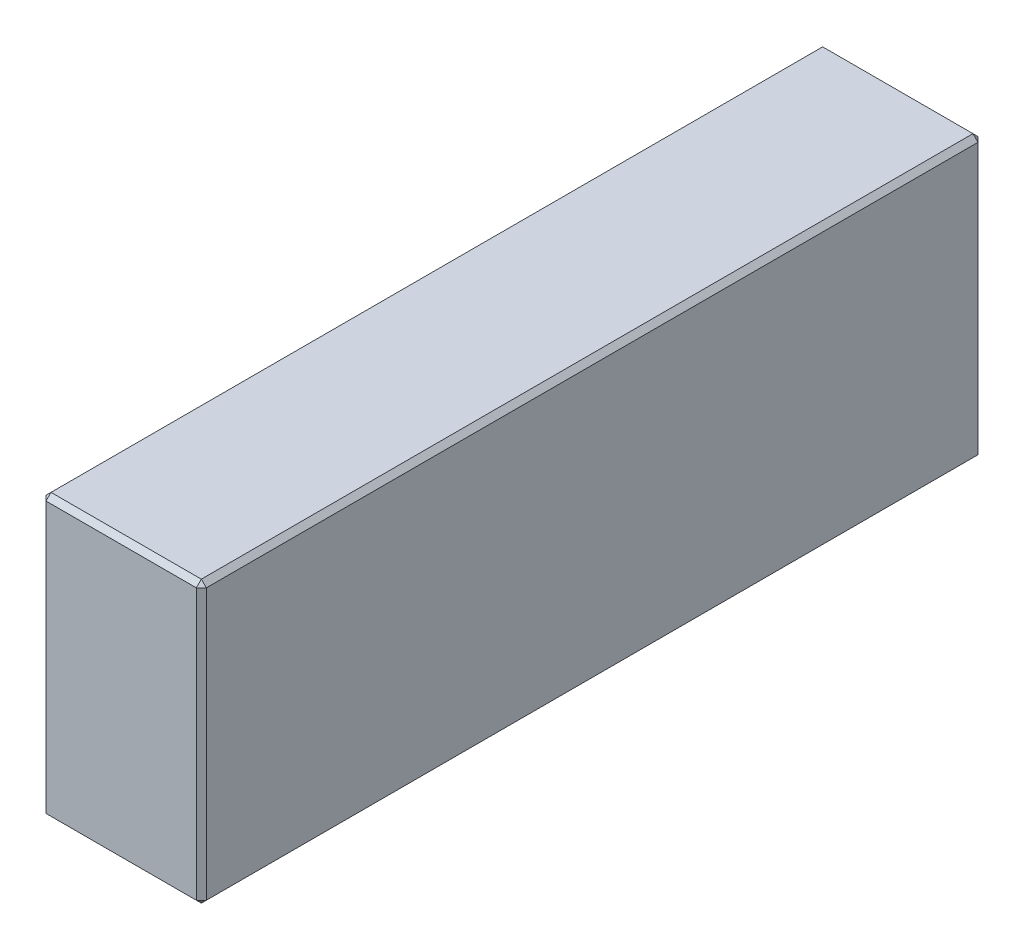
ISO-10303-21;
HEADER;
FILE_DESCRIPTION(('STEP AP214'),'2;1');
FILE_NAME('part.step','',(''),(''),'','','');
FILE_SCHEMA(('AUTOMOTIVE_DESIGN { 1 0 10303 214 1 1 1 1 }'));
ENDSEC;
DATA;
#1=APPLICATION_CONTEXT('core data for automotive mechanical design processes');
#2=APPLICATION_PROTOCOL_DEFINITION('international standard','automotive_design',2000,#1);
#3=PRODUCT_CONTEXT('',#1,'mechanical');
#4=PRODUCT('Part','Part','',(#3));
#5=PRODUCT_RELATED_PRODUCT_CATEGORY('part','',(#4));
#6=PRODUCT_DEFINITION_FORMATION('','',#4);
#7=PRODUCT_DEFINITION_CONTEXT('part definition',#1,'design');
#8=PRODUCT_DEFINITION('design','',#6,#7);
#9=PRODUCT_DEFINITION_SHAPE('','',#8);
#10=(LENGTH_UNIT() NAMED_UNIT(*) SI_UNIT(.MILLI.,.METRE.));
#11=(NAMED_UNIT(*) PLANE_ANGLE_UNIT() SI_UNIT($,.RADIAN.));
#12=(NAMED_UNIT(*) SI_UNIT($,.STERADIAN.) SOLID_ANGLE_UNIT());
#13=UNCERTAINTY_MEASURE_WITH_UNIT(LENGTH_MEASURE(1.E-05),#10,'distance_accuracy_value','');
#14=(GEOMETRIC_REPRESENTATION_CONTEXT(3) GLOBAL_UNCERTAINTY_ASSIGNED_CONTEXT((#13)) GLOBAL_UNIT_ASSIGNED_CONTEXT((#10,
#11,#12)) REPRESENTATION_CONTEXT('',''));
#15=CARTESIAN_POINT('',(0.,0.,0.));
#16=DIRECTION('',(0.,0.,1.));
#17=DIRECTION('',(1.,0.,0.));
#18=AXIS2_PLACEMENT_3D('',#15,#16,#17);
#19=CARTESIAN_POINT('',(-16.,56.,78.));
#20=DIRECTION('',(1.,0.,0.));
#21=DIRECTION('',(0.,0.,-1.));
#22=AXIS2_PLACEMENT_3D('',#19,#20,#21);
#23=PLANE('',#22);
#24=DIRECTION('',(0.,-1.,0.));
#25=VECTOR('',#24,1.);
#26=CARTESIAN_POINT('',(-16.,56.,-77.));
#27=LINE('',#26,#25);
#28=CARTESIAN_POINT('',(-16.,55.,-77.));
#29=VERTEX_POINT('',#28);
#30=CARTESIAN_POINT('',(-16.,0.999999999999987,-77.));
#31=VERTEX_POINT('',#30);
#32=EDGE_CURVE('E114',#29,#31,#27,.T.);
#33=ORIENTED_EDGE('',*,*,#32,.T.);
#34=DIRECTION('',(0.,0.,1.));
#35=VECTOR('',#34,1.);
#36=CARTESIAN_POINT('',(-16.,0.999999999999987,78.));
#37=LINE('',#36,#35);
#38=CARTESIAN_POINT('',(-16.,0.999999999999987,77.));
#39=VERTEX_POINT('',#38);
#40=EDGE_CURVE('E110',#31,#39,#37,.T.);
#41=ORIENTED_EDGE('',*,*,#40,.T.);
#42=DIRECTION('',(0.,1.,0.));
#43=VECTOR('',#42,1.);
#44=CARTESIAN_POINT('',(-16.,56.,77.));
#45=LINE('',#44,#43);
#46=CARTESIAN_POINT('',(-16.,55.,77.));
#47=VERTEX_POINT('',#46);
#48=EDGE_CURVE('E103',#39,#47,#45,.T.);
#49=ORIENTED_EDGE('',*,*,#48,.T.);
#50=DIRECTION('',(0.,0.,-1.));
#51=VECTOR('',#50,1.);
#52=CARTESIAN_POINT('',(-16.,55.,-78.));
#53=LINE('',#52,#51);
#54=EDGE_CURVE('E107',#47,#29,#53,.T.);
#55=ORIENTED_EDGE('',*,*,#54,.T.);
#56=EDGE_LOOP('',(#33,#41,#49,#55));
#57=FACE_BOUND('',#56,.T.);
#58=ADVANCED_FACE('F15',(#57),#23,.F.);
#59=CARTESIAN_POINT('',(16.,56.,78.));
#60=DIRECTION('',(0.,0.,-1.));
#61=DIRECTION('',(-1.,0.,0.));
#62=AXIS2_PLACEMENT_3D('',#59,#60,#61);
#63=PLANE('',#62);
#64=DIRECTION('',(-1.,0.,0.));
#65=VECTOR('',#64,1.);
#66=CARTESIAN_POINT('',(-16.,55.,78.));
#67=LINE('',#66,#65);
#68=CARTESIAN_POINT('',(15.,55.,78.));
#69=VERTEX_POINT('',#68);
#70=CARTESIAN_POINT('',(-15.,55.,78.));
#71=VERTEX_POINT('',#70);
#72=EDGE_CURVE('E164',#69,#71,#67,.T.);
#73=ORIENTED_EDGE('',*,*,#72,.T.);
#74=DIRECTION('',(0.,-1.,0.));
#75=VECTOR('',#74,1.);
#76=CARTESIAN_POINT('',(-15.,56.,78.));
#77=LINE('',#76,#75);
#78=CARTESIAN_POINT('',(-15.,0.999999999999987,78.));
#79=VERTEX_POINT('',#78);
#80=EDGE_CURVE('E122',#71,#79,#77,.T.);
#81=ORIENTED_EDGE('',*,*,#80,.T.);
#82=DIRECTION('',(1.,0.,0.));
#83=VECTOR('',#82,1.);
#84=CARTESIAN_POINT('',(16.,0.999999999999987,78.));
#85=LINE('',#84,#83);
#86=CARTESIAN_POINT('',(15.,0.999999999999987,78.));
#87=VERTEX_POINT('',#86);
#88=EDGE_CURVE('E168',#79,#87,#85,.T.);
#89=ORIENTED_EDGE('',*,*,#88,.T.);
#90=DIRECTION('',(0.,1.,0.));
#91=VECTOR('',#90,1.);
#92=CARTESIAN_POINT('',(15.,56.,78.));
#93=LINE('',#92,#91);
#94=EDGE_CURVE('E166',#87,#69,#93,.T.);
#95=ORIENTED_EDGE('',*,*,#94,.T.);
#96=EDGE_LOOP('',(#73,#81,#89,#95));
#97=FACE_BOUND('',#96,.T.);
#98=ADVANCED_FACE('F275',(#97),#63,.F.);
#99=CARTESIAN_POINT('',(16.,56.,78.));
#100=DIRECTION('',(-1.,0.,0.));
#101=DIRECTION('',(0.,0.,1.));
#102=AXIS2_PLACEMENT_3D('',#99,#100,#101);
#103=PLANE('',#102);
#104=DIRECTION('',(0.,0.,-1.));
#105=VECTOR('',#104,1.);
#106=CARTESIAN_POINT('',(16.,0.999999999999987,78.));
#107=LINE('',#106,#105);
#108=CARTESIAN_POINT('',(16.,0.999999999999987,77.));
#109=VERTEX_POINT('',#108);
#110=CARTESIAN_POINT('',(16.,0.999999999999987,-77.));
#111=VERTEX_POINT('',#110);
#112=EDGE_CURVE('E159',#109,#111,#107,.T.);
#113=ORIENTED_EDGE('',*,*,#112,.T.);
#114=DIRECTION('',(0.,1.,0.));
#115=VECTOR('',#114,1.);
#116=CARTESIAN_POINT('',(16.,56.,-77.));
#117=LINE('',#116,#115);
#118=CARTESIAN_POINT('',(16.,55.,-77.));
#119=VERTEX_POINT('',#118);
#120=EDGE_CURVE('E161',#111,#119,#117,.T.);
#121=ORIENTED_EDGE('',*,*,#120,.T.);
#122=DIRECTION('',(0.,0.,1.));
#123=VECTOR('',#122,1.);
#124=CARTESIAN_POINT('',(16.,55.,78.));
#125=LINE('',#124,#123);
#126=CARTESIAN_POINT('',(16.,55.,77.));
#127=VERTEX_POINT('',#126);
#128=EDGE_CURVE('E155',#119,#127,#125,.T.);
#129=ORIENTED_EDGE('',*,*,#128,.T.);
#130=DIRECTION('',(0.,-1.,0.));
#131=VECTOR('',#130,1.);
#132=CARTESIAN_POINT('',(16.,56.,77.));
#133=LINE('',#132,#131);
#134=EDGE_CURVE('E157',#127,#109,#133,.T.);
#135=ORIENTED_EDGE('',*,*,#134,.T.);
#136=EDGE_LOOP('',(#113,#121,#129,#135));
#137=FACE_BOUND('',#136,.T.);
#138=ADVANCED_FACE('F254',(#137),#103,.F.);
#139=CARTESIAN_POINT('',(16.,56.,-78.));
#140=DIRECTION('',(0.,0.,1.));
#141=DIRECTION('',(1.,0.,0.));
#142=AXIS2_PLACEMENT_3D('',#139,#140,#141);
#143=PLANE('',#142);
#144=DIRECTION('',(0.,-1.,0.));
#145=VECTOR('',#144,1.);
#146=CARTESIAN_POINT('',(15.,56.,-78.));
#147=LINE('',#146,#145);
#148=CARTESIAN_POINT('',(15.,55.,-78.));
#149=VERTEX_POINT('',#148);
#150=CARTESIAN_POINT('',(15.,0.999999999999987,-78.));
#151=VERTEX_POINT('',#150);
#152=EDGE_CURVE('E148',#149,#151,#147,.T.);
#153=ORIENTED_EDGE('',*,*,#152,.T.);
#154=DIRECTION('',(-1.,0.,0.));
#155=VECTOR('',#154,1.);
#156=CARTESIAN_POINT('',(16.,0.999999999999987,-78.));
#157=LINE('',#156,#155);
#158=CARTESIAN_POINT('',(-15.,0.999999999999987,-78.));
#159=VERTEX_POINT('',#158);
#160=EDGE_CURVE('E153',#151,#159,#157,.T.);
#161=ORIENTED_EDGE('',*,*,#160,.T.);
#162=DIRECTION('',(0.,1.,0.));
#163=VECTOR('',#162,1.);
#164=CARTESIAN_POINT('',(-15.,56.,-78.));
#165=LINE('',#164,#163);
#166=CARTESIAN_POINT('',(-15.,55.,-78.));
#167=VERTEX_POINT('',#166);
#168=EDGE_CURVE('E150',#159,#167,#165,.T.);
#169=ORIENTED_EDGE('',*,*,#168,.T.);
#170=DIRECTION('',(1.,0.,0.));
#171=VECTOR('',#170,1.);
#172=CARTESIAN_POINT('',(16.,55.,-78.));
#173=LINE('',#172,#171);
#174=EDGE_CURVE('E146',#167,#149,#173,.T.);
#175=ORIENTED_EDGE('',*,*,#174,.T.);
#176=EDGE_LOOP('',(#153,#161,#169,#175));
#177=FACE_BOUND('',#176,.T.);
#178=ADVANCED_FACE('F284',(#177),#143,.F.);
#179=CARTESIAN_POINT('',(0.,56.,0.));
#180=DIRECTION('',(0.,1.,0.));
#181=DIRECTION('',(0.,0.,1.));
#182=AXIS2_PLACEMENT_3D('',#179,#180,#181);
#183=PLANE('',#182);
#184=DIRECTION('',(0.,0.,-1.));
#185=VECTOR('',#184,1.);
#186=CARTESIAN_POINT('',(15.,56.,-78.));
#187=LINE('',#186,#185);
#188=CARTESIAN_POINT('',(15.,56.,77.));
#189=VERTEX_POINT('',#188);
#190=CARTESIAN_POINT('',(15.,56.,-77.));
#191=VERTEX_POINT('',#190);
#192=EDGE_CURVE('E24',#189,#191,#187,.T.);
#193=ORIENTED_EDGE('',*,*,#192,.T.);
#194=DIRECTION('',(-1.,0.,0.));
#195=VECTOR('',#194,1.);
#196=CARTESIAN_POINT('',(-16.,56.,-77.));
#197=LINE('',#196,#195);
#198=CARTESIAN_POINT('',(-15.,56.,-77.));
#199=VERTEX_POINT('',#198);
#200=EDGE_CURVE('E9',#191,#199,#197,.T.);
#201=ORIENTED_EDGE('',*,*,#200,.T.);
#202=DIRECTION('',(0.,0.,1.));
#203=VECTOR('',#202,1.);
#204=CARTESIAN_POINT('',(-15.,56.,78.));
#205=LINE('',#204,#203);
#206=CARTESIAN_POINT('',(-15.,56.,77.));
#207=VERTEX_POINT('',#206);
#208=EDGE_CURVE('E180',#199,#207,#205,.T.);
#209=ORIENTED_EDGE('',*,*,#208,.T.);
#210=DIRECTION('',(1.,0.,0.));
#211=VECTOR('',#210,1.);
#212=CARTESIAN_POINT('',(16.,56.,77.));
#213=LINE('',#212,#211);
#214=EDGE_CURVE('E35',#207,#189,#213,.T.);
#215=ORIENTED_EDGE('',*,*,#214,.T.);
#216=EDGE_LOOP('',(#193,#201,#209,#215));
#217=FACE_BOUND('',#216,.T.);
#218=ADVANCED_FACE('F350',(#217),#183,.T.);
#219=CARTESIAN_POINT('',(0.,0.,0.));
#220=DIRECTION('',(0.,1.,0.));
#221=DIRECTION('',(0.,0.,1.));
#222=AXIS2_PLACEMENT_3D('',#219,#220,#221);
#223=PLANE('',#222);
#224=DIRECTION('',(0.,0.,1.));
#225=VECTOR('',#224,1.);
#226=CARTESIAN_POINT('',(15.,0.,0.));
#227=LINE('',#226,#225);
#228=CARTESIAN_POINT('',(15.,0.,-77.));
#229=VERTEX_POINT('',#228);
#230=CARTESIAN_POINT('',(15.,0.,77.));
#231=VERTEX_POINT('',#230);
#232=EDGE_CURVE('E171',#229,#231,#227,.T.);
#233=ORIENTED_EDGE('',*,*,#232,.T.);
#234=DIRECTION('',(-1.,0.,0.));
#235=VECTOR('',#234,1.);
#236=CARTESIAN_POINT('',(0.,0.,77.));
#237=LINE('',#236,#235);
#238=CARTESIAN_POINT('',(-15.,0.,77.));
#239=VERTEX_POINT('',#238);
#240=EDGE_CURVE('E177',#231,#239,#237,.T.);
#241=ORIENTED_EDGE('',*,*,#240,.T.);
#242=DIRECTION('',(0.,0.,-1.));
#243=VECTOR('',#242,1.);
#244=CARTESIAN_POINT('',(-15.,0.,0.));
#245=LINE('',#244,#243);
#246=CARTESIAN_POINT('',(-15.,0.,-77.));
#247=VERTEX_POINT('',#246);
#248=EDGE_CURVE('E175',#239,#247,#245,.T.);
#249=ORIENTED_EDGE('',*,*,#248,.T.);
#250=DIRECTION('',(1.,0.,0.));
#251=VECTOR('',#250,1.);
#252=CARTESIAN_POINT('',(0.,0.,-77.));
#253=LINE('',#252,#251);
#254=EDGE_CURVE('E173',#247,#229,#253,.T.);
#255=ORIENTED_EDGE('',*,*,#254,.T.);
#256=EDGE_LOOP('',(#233,#241,#249,#255));
#257=FACE_BOUND('',#256,.T.);
#258=ADVANCED_FACE('F246',(#257),#223,.F.);
#259=CARTESIAN_POINT('',(16.,56.,77.));
#260=DIRECTION('',(-0.707106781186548,0.,-0.707106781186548));
#261=DIRECTION('',(0.,-1.,0.));
#262=AXIS2_PLACEMENT_3D('',#259,#260,#261);
#263=PLANE('',#262);
#264=DIRECTION('',(-0.707106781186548,0.,0.707106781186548));
#265=VECTOR('',#264,1.);
#266=CARTESIAN_POINT('',(15.,55.,78.));
#267=LINE('',#266,#265);
#268=EDGE_CURVE('E19',#69,#127,#267,.F.);
#269=ORIENTED_EDGE('',*,*,#268,.F.);
#270=ORIENTED_EDGE('',*,*,#94,.F.);
#271=DIRECTION('',(0.707106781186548,0.,-0.707106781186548));
#272=VECTOR('',#271,1.);
#273=CARTESIAN_POINT('',(15.,0.999999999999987,78.));
#274=LINE('',#273,#272);
#275=EDGE_CURVE('E142',#109,#87,#274,.F.);
#276=ORIENTED_EDGE('',*,*,#275,.F.);
#277=ORIENTED_EDGE('',*,*,#134,.F.);
#278=EDGE_LOOP('',(#269,#270,#276,#277));
#279=FACE_BOUND('',#278,.T.);
#280=ADVANCED_FACE('F17',(#279),#263,.F.);
#281=CARTESIAN_POINT('',(15.,55.,78.));
#282=DIRECTION('',(0.577350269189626,0.577350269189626,0.577350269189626));
#283=DIRECTION('',(0.707106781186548,0.,-0.707106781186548));
#284=AXIS2_PLACEMENT_3D('',#281,#282,#283);
#285=PLANE('',#284);
#286=DIRECTION('',(0.,-0.707106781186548,0.707106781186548));
#287=VECTOR('',#286,1.);
#288=CARTESIAN_POINT('',(15.,55.,78.));
#289=LINE('',#288,#287);
#290=EDGE_CURVE('E226',#69,#189,#289,.F.);
#291=ORIENTED_EDGE('',*,*,#290,.F.);
#292=ORIENTED_EDGE('',*,*,#268,.T.);
#293=DIRECTION('',(-0.707106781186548,0.707106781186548,0.));
#294=VECTOR('',#293,1.);
#295=CARTESIAN_POINT('',(15.5,55.5,77.));
#296=LINE('',#295,#294);
#297=EDGE_CURVE('E228',#189,#127,#296,.F.);
#298=ORIENTED_EDGE('',*,*,#297,.F.);
#299=EDGE_LOOP('',(#291,#292,#298));
#300=FACE_BOUND('',#299,.T.);
#301=ADVANCED_FACE('F270',(#300),#285,.T.);
#302=CARTESIAN_POINT('',(15.,0.999999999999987,78.));
#303=DIRECTION('',(0.577350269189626,-0.577350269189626,0.577350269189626));
#304=DIRECTION('',(0.707106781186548,0.,-0.707106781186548));
#305=AXIS2_PLACEMENT_3D('',#302,#303,#304);
#306=PLANE('',#305);
#307=DIRECTION('',(-0.707106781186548,-0.707106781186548,0.));
#308=VECTOR('',#307,1.);
#309=CARTESIAN_POINT('',(15.5,0.499999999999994,77.));
#310=LINE('',#309,#308);
#311=EDGE_CURVE('E220',#109,#231,#310,.T.);
#312=ORIENTED_EDGE('',*,*,#311,.F.);
#313=ORIENTED_EDGE('',*,*,#275,.T.);
#314=DIRECTION('',(0.,0.707106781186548,0.707106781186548));
#315=VECTOR('',#314,1.);
#316=CARTESIAN_POINT('',(15.,0.999999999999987,78.));
#317=LINE('',#316,#315);
#318=EDGE_CURVE('E223',#231,#87,#317,.T.);
#319=ORIENTED_EDGE('',*,*,#318,.F.);
#320=EDGE_LOOP('',(#312,#313,#319));
#321=FACE_BOUND('',#320,.T.);
#322=ADVANCED_FACE('F235',(#321),#306,.T.);
#323=CARTESIAN_POINT('',(15.,56.,0.));
#324=DIRECTION('',(0.707106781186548,0.707106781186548,0.));
#325=DIRECTION('',(0.,0.,1.));
#326=AXIS2_PLACEMENT_3D('',#323,#324,#325);
#327=PLANE('',#326);
#328=ORIENTED_EDGE('',*,*,#297,.T.);
#329=ORIENTED_EDGE('',*,*,#128,.F.);
#330=DIRECTION('',(0.707106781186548,-0.707106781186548,0.));
#331=VECTOR('',#330,1.);
#332=CARTESIAN_POINT('',(16.,55.,-77.));
#333=LINE('',#332,#331);
#334=EDGE_CURVE('E215',#191,#119,#333,.T.);
#335=ORIENTED_EDGE('',*,*,#334,.F.);
#336=ORIENTED_EDGE('',*,*,#192,.F.);
#337=EDGE_LOOP('',(#328,#329,#335,#336));
#338=FACE_BOUND('',#337,.T.);
#339=ADVANCED_FACE('F265',(#338),#327,.T.);
#340=CARTESIAN_POINT('',(0.,56.,77.));
#341=DIRECTION('',(0.,0.707106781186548,0.707106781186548));
#342=DIRECTION('',(-1.,0.,0.));
#343=AXIS2_PLACEMENT_3D('',#340,#341,#342);
#344=PLANE('',#343);
#345=ORIENTED_EDGE('',*,*,#290,.T.);
#346=ORIENTED_EDGE('',*,*,#214,.F.);
#347=DIRECTION('',(0.,0.707106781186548,-0.707106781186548));
#348=VECTOR('',#347,1.);
#349=CARTESIAN_POINT('',(-15.,55.5,77.5));
#350=LINE('',#349,#348);
#351=EDGE_CURVE('E126',#71,#207,#350,.T.);
#352=ORIENTED_EDGE('',*,*,#351,.F.);
#353=ORIENTED_EDGE('',*,*,#72,.F.);
#354=EDGE_LOOP('',(#345,#346,#352,#353));
#355=FACE_BOUND('',#354,.T.);
#356=ADVANCED_FACE('F273',(#355),#344,.T.);
#357=CARTESIAN_POINT('',(-15.,56.,78.));
#358=DIRECTION('',(0.707106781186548,0.,-0.707106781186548));
#359=DIRECTION('',(0.,-1.,0.));
#360=AXIS2_PLACEMENT_3D('',#357,#358,#359);
#361=PLANE('',#360);
#362=DIRECTION('',(0.707106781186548,0.,0.707106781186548));
#363=VECTOR('',#362,1.);
#364=CARTESIAN_POINT('',(-15.,0.999999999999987,78.));
#365=LINE('',#364,#363);
#366=EDGE_CURVE('E127',#79,#39,#365,.F.);
#367=ORIENTED_EDGE('',*,*,#366,.F.);
#368=ORIENTED_EDGE('',*,*,#80,.F.);
#369=DIRECTION('',(-0.707106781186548,0.,-0.707106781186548));
#370=VECTOR('',#369,1.);
#371=CARTESIAN_POINT('',(-16.,55.,77.));
#372=LINE('',#371,#370);
#373=EDGE_CURVE('E118',#47,#71,#372,.F.);
#374=ORIENTED_EDGE('',*,*,#373,.F.);
#375=ORIENTED_EDGE('',*,*,#48,.F.);
#376=EDGE_LOOP('',(#367,#368,#374,#375));
#377=FACE_BOUND('',#376,.T.);
#378=ADVANCED_FACE('F120',(#377),#361,.F.);
#379=CARTESIAN_POINT('',(16.,0.999999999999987,78.));
#380=DIRECTION('',(0.,0.707106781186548,-0.707106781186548));
#381=DIRECTION('',(1.,0.,0.));
#382=AXIS2_PLACEMENT_3D('',#379,#380,#381);
#383=PLANE('',#382);
#384=ORIENTED_EDGE('',*,*,#318,.T.);
#385=ORIENTED_EDGE('',*,*,#88,.F.);
#386=DIRECTION('',(0.,-0.707106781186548,-0.707106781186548));
#387=VECTOR('',#386,1.);
#388=CARTESIAN_POINT('',(-15.,0.999999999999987,78.));
#389=LINE('',#388,#387);
#390=EDGE_CURVE('E211',#239,#79,#389,.F.);
#391=ORIENTED_EDGE('',*,*,#390,.F.);
#392=ORIENTED_EDGE('',*,*,#240,.F.);
#393=EDGE_LOOP('',(#384,#385,#391,#392));
#394=FACE_BOUND('',#393,.T.);
#395=ADVANCED_FACE('F243',(#394),#383,.F.);
#396=CARTESIAN_POINT('',(16.,0.999999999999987,78.));
#397=DIRECTION('',(-0.707106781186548,0.707106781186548,0.));
#398=DIRECTION('',(0.,0.,-1.));
#399=AXIS2_PLACEMENT_3D('',#396,#397,#398);
#400=PLANE('',#399);
#401=ORIENTED_EDGE('',*,*,#311,.T.);
#402=ORIENTED_EDGE('',*,*,#232,.F.);
#403=DIRECTION('',(0.707106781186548,0.707106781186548,0.));
#404=VECTOR('',#403,1.);
#405=CARTESIAN_POINT('',(15.5,0.499999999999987,-77.));
#406=LINE('',#405,#404);
#407=EDGE_CURVE('E208',#111,#229,#406,.F.);
#408=ORIENTED_EDGE('',*,*,#407,.F.);
#409=ORIENTED_EDGE('',*,*,#112,.F.);
#410=EDGE_LOOP('',(#401,#402,#408,#409));
#411=FACE_BOUND('',#410,.T.);
#412=ADVANCED_FACE('F251',(#411),#400,.F.);
#413=CARTESIAN_POINT('',(15.,56.,-78.));
#414=DIRECTION('',(-0.707106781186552,0.,0.707106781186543));
#415=DIRECTION('',(0.,-1.,0.));
#416=AXIS2_PLACEMENT_3D('',#413,#414,#415);
#417=PLANE('',#416);
#418=DIRECTION('',(0.707106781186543,0.,0.707106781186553));
#419=VECTOR('',#418,1.);
#420=CARTESIAN_POINT('',(16.,55.,-77.));
#421=LINE('',#420,#419);
#422=EDGE_CURVE('E217',#119,#149,#421,.F.);
#423=ORIENTED_EDGE('',*,*,#422,.F.);
#424=ORIENTED_EDGE('',*,*,#120,.F.);
#425=DIRECTION('',(-0.707106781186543,0.,-0.707106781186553));
#426=VECTOR('',#425,1.);
#427=CARTESIAN_POINT('',(15.,0.999999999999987,-78.));
#428=LINE('',#427,#426);
#429=EDGE_CURVE('E205',#151,#111,#428,.F.);
#430=ORIENTED_EDGE('',*,*,#429,.F.);
#431=ORIENTED_EDGE('',*,*,#152,.F.);
#432=EDGE_LOOP('',(#423,#424,#430,#431));
#433=FACE_BOUND('',#432,.T.);
#434=ADVANCED_FACE('F258',(#433),#417,.F.);
#435=CARTESIAN_POINT('',(16.,55.,-77.));
#436=DIRECTION('',(0.577350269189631,0.577350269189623,-0.577350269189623));
#437=DIRECTION('',(-0.707106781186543,0.,-0.707106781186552));
#438=AXIS2_PLACEMENT_3D('',#435,#436,#437);
#439=PLANE('',#438);
#440=ORIENTED_EDGE('',*,*,#334,.T.);
#441=ORIENTED_EDGE('',*,*,#422,.T.);
#442=DIRECTION('',(0.,0.707106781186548,0.707106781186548));
#443=VECTOR('',#442,1.);
#444=CARTESIAN_POINT('',(15.,55.5,-77.5));
#445=LINE('',#444,#443);
#446=EDGE_CURVE('E134',#191,#149,#445,.F.);
#447=ORIENTED_EDGE('',*,*,#446,.F.);
#448=EDGE_LOOP('',(#440,#441,#447));
#449=FACE_BOUND('',#448,.T.);
#450=ADVANCED_FACE('F325',(#449),#439,.T.);
#451=CARTESIAN_POINT('',(-16.,55.,77.));
#452=DIRECTION('',(-0.577350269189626,0.577350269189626,0.577350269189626));
#453=DIRECTION('',(0.707106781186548,0.,0.707106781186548));
#454=AXIS2_PLACEMENT_3D('',#451,#452,#453);
#455=PLANE('',#454);
#456=ORIENTED_EDGE('',*,*,#373,.T.);
#457=ORIENTED_EDGE('',*,*,#351,.T.);
#458=DIRECTION('',(-0.707106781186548,-0.707106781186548,0.));
#459=VECTOR('',#458,1.);
#460=CARTESIAN_POINT('',(-16.,55.,77.));
#461=LINE('',#460,#459);
#462=EDGE_CURVE('E130',#47,#207,#461,.F.);
#463=ORIENTED_EDGE('',*,*,#462,.F.);
#464=EDGE_LOOP('',(#456,#457,#463));
#465=FACE_BOUND('',#464,.T.);
#466=ADVANCED_FACE('F131',(#465),#455,.T.);
#467=CARTESIAN_POINT('',(-15.,0.999999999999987,78.));
#468=DIRECTION('',(-0.577350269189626,-0.577350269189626,0.577350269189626));
#469=DIRECTION('',(0.707106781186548,0.,0.707106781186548));
#470=AXIS2_PLACEMENT_3D('',#467,#468,#469);
#471=PLANE('',#470);
#472=ORIENTED_EDGE('',*,*,#390,.T.);
#473=ORIENTED_EDGE('',*,*,#366,.T.);
#474=DIRECTION('',(-0.707106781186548,0.707106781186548,0.));
#475=VECTOR('',#474,1.);
#476=CARTESIAN_POINT('',(-15.5,0.499999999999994,77.));
#477=LINE('',#476,#475);
#478=EDGE_CURVE('E135',#239,#39,#477,.T.);
#479=ORIENTED_EDGE('',*,*,#478,.F.);
#480=EDGE_LOOP('',(#472,#473,#479));
#481=FACE_BOUND('',#480,.T.);
#482=ADVANCED_FACE('F318',(#481),#471,.T.);
#483=CARTESIAN_POINT('',(15.,0.999999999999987,-78.));
#484=DIRECTION('',(0.577350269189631,-0.577350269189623,-0.577350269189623));
#485=DIRECTION('',(-0.707106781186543,0.,-0.707106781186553));
#486=AXIS2_PLACEMENT_3D('',#483,#484,#485);
#487=PLANE('',#486);
#488=ORIENTED_EDGE('',*,*,#429,.T.);
#489=ORIENTED_EDGE('',*,*,#407,.T.);
#490=DIRECTION('',(0.,-0.707106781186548,0.707106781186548));
#491=VECTOR('',#490,1.);
#492=CARTESIAN_POINT('',(15.,0.999999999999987,-78.));
#493=LINE('',#492,#491);
#494=EDGE_CURVE('E198',#151,#229,#493,.T.);
#495=ORIENTED_EDGE('',*,*,#494,.F.);
#496=EDGE_LOOP('',(#488,#489,#495));
#497=FACE_BOUND('',#496,.T.);
#498=ADVANCED_FACE('F314',(#497),#487,.T.);
#499=CARTESIAN_POINT('',(0.,56.,-77.));
#500=DIRECTION('',(0.,0.707106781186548,-0.707106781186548));
#501=DIRECTION('',(1.,0.,0.));
#502=AXIS2_PLACEMENT_3D('',#499,#500,#501);
#503=PLANE('',#502);
#504=ORIENTED_EDGE('',*,*,#446,.T.);
#505=ORIENTED_EDGE('',*,*,#174,.F.);
#506=DIRECTION('',(0.,-0.707106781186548,-0.707106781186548));
#507=VECTOR('',#506,1.);
#508=CARTESIAN_POINT('',(-15.,55.,-78.));
#509=LINE('',#508,#507);
#510=EDGE_CURVE('E195',#199,#167,#509,.T.);
#511=ORIENTED_EDGE('',*,*,#510,.F.);
#512=ORIENTED_EDGE('',*,*,#200,.F.);
#513=EDGE_LOOP('',(#504,#505,#511,#512));
#514=FACE_BOUND('',#513,.T.);
#515=ADVANCED_FACE('F311',(#514),#503,.T.);
#516=CARTESIAN_POINT('',(-15.,56.,0.));
#517=DIRECTION('',(-0.707106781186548,0.707106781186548,0.));
#518=DIRECTION('',(0.,0.,-1.));
#519=AXIS2_PLACEMENT_3D('',#516,#517,#518);
#520=PLANE('',#519);
#521=ORIENTED_EDGE('',*,*,#462,.T.);
#522=ORIENTED_EDGE('',*,*,#208,.F.);
#523=DIRECTION('',(0.707106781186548,0.707106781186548,0.));
#524=VECTOR('',#523,1.);
#525=CARTESIAN_POINT('',(-15.5,55.5,-77.));
#526=LINE('',#525,#524);
#527=EDGE_CURVE('E138',#29,#199,#526,.T.);
#528=ORIENTED_EDGE('',*,*,#527,.F.);
#529=ORIENTED_EDGE('',*,*,#54,.F.);
#530=EDGE_LOOP('',(#521,#522,#528,#529));
#531=FACE_BOUND('',#530,.T.);
#532=ADVANCED_FACE('F137',(#531),#520,.T.);
#533=CARTESIAN_POINT('',(-16.,0.999999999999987,78.));
#534=DIRECTION('',(0.707106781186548,0.707106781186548,0.));
#535=DIRECTION('',(0.,0.,1.));
#536=AXIS2_PLACEMENT_3D('',#533,#534,#535);
#537=PLANE('',#536);
#538=ORIENTED_EDGE('',*,*,#478,.T.);
#539=ORIENTED_EDGE('',*,*,#40,.F.);
#540=DIRECTION('',(0.707106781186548,-0.707106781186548,0.));
#541=VECTOR('',#540,1.);
#542=CARTESIAN_POINT('',(-16.,0.999999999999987,-77.));
#543=LINE('',#542,#541);
#544=EDGE_CURVE('E191',#247,#31,#543,.F.);
#545=ORIENTED_EDGE('',*,*,#544,.F.);
#546=ORIENTED_EDGE('',*,*,#248,.F.);
#547=EDGE_LOOP('',(#538,#539,#545,#546));
#548=FACE_BOUND('',#547,.T.);
#549=ADVANCED_FACE('F304',(#548),#537,.F.);
#550=CARTESIAN_POINT('',(16.,0.999999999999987,-78.));
#551=DIRECTION('',(0.,0.707106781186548,0.707106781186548));
#552=DIRECTION('',(-1.,0.,0.));
#553=AXIS2_PLACEMENT_3D('',#550,#551,#552);
#554=PLANE('',#553);
#555=ORIENTED_EDGE('',*,*,#494,.T.);
#556=ORIENTED_EDGE('',*,*,#254,.F.);
#557=DIRECTION('',(0.,0.707106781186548,-0.707106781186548));
#558=VECTOR('',#557,1.);
#559=CARTESIAN_POINT('',(-15.,0.5,-77.5));
#560=LINE('',#559,#558);
#561=EDGE_CURVE('E188',#159,#247,#560,.F.);
#562=ORIENTED_EDGE('',*,*,#561,.F.);
#563=ORIENTED_EDGE('',*,*,#160,.F.);
#564=EDGE_LOOP('',(#555,#556,#562,#563));
#565=FACE_BOUND('',#564,.T.);
#566=ADVANCED_FACE('F300',(#565),#554,.F.);
#567=CARTESIAN_POINT('',(-15.,55.,-78.));
#568=DIRECTION('',(-0.577350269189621,0.577350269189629,-0.577350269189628));
#569=DIRECTION('',(0.,0.707106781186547,0.707106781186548));
#570=AXIS2_PLACEMENT_3D('',#567,#568,#569);
#571=PLANE('',#570);
#572=ORIENTED_EDGE('',*,*,#527,.T.);
#573=ORIENTED_EDGE('',*,*,#510,.T.);
#574=DIRECTION('',(0.707106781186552,0.,-0.707106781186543));
#575=VECTOR('',#574,1.);
#576=CARTESIAN_POINT('',(-15.,55.,-78.));
#577=LINE('',#576,#575);
#578=EDGE_CURVE('E186',#29,#167,#577,.T.);
#579=ORIENTED_EDGE('',*,*,#578,.F.);
#580=EDGE_LOOP('',(#572,#573,#579));
#581=FACE_BOUND('',#580,.T.);
#582=ADVANCED_FACE('F296',(#581),#571,.T.);
#583=CARTESIAN_POINT('',(-16.,0.999999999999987,-77.));
#584=DIRECTION('',(-0.577350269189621,-0.577350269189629,-0.577350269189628));
#585=DIRECTION('',(0.,0.707106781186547,-0.707106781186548));
#586=AXIS2_PLACEMENT_3D('',#583,#584,#585);
#587=PLANE('',#586);
#588=ORIENTED_EDGE('',*,*,#561,.T.);
#589=ORIENTED_EDGE('',*,*,#544,.T.);
#590=DIRECTION('',(-0.707106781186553,0.,0.707106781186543));
#591=VECTOR('',#590,1.);
#592=CARTESIAN_POINT('',(-16.,0.999999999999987,-77.));
#593=LINE('',#592,#591);
#594=EDGE_CURVE('E184',#159,#31,#593,.T.);
#595=ORIENTED_EDGE('',*,*,#594,.F.);
#596=EDGE_LOOP('',(#588,#589,#595));
#597=FACE_BOUND('',#596,.T.);
#598=ADVANCED_FACE('F292',(#597),#587,.T.);
#599=CARTESIAN_POINT('',(-16.,56.,-77.));
#600=DIRECTION('',(0.707106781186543,0.,0.707106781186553));
#601=DIRECTION('',(0.,-1.,0.));
#602=AXIS2_PLACEMENT_3D('',#599,#600,#601);
#603=PLANE('',#602);
#604=ORIENTED_EDGE('',*,*,#578,.T.);
#605=ORIENTED_EDGE('',*,*,#168,.F.);
#606=ORIENTED_EDGE('',*,*,#594,.T.);
#607=ORIENTED_EDGE('',*,*,#32,.F.);
#608=EDGE_LOOP('',(#604,#605,#606,#607));
#609=FACE_BOUND('',#608,.T.);
#610=ADVANCED_FACE('F289',(#609),#603,.F.);
#611=CLOSED_SHELL('',(#58,#98,#138,#178,#218,#258,#280,#301,#322,#339,#356,#378,#395,#412,#434,
#450,#466,#482,#498,#515,#532,#549,#566,#582,#598,#610));
#612=MANIFOLD_SOLID_BREP('B1',#611);
#613=ADVANCED_BREP_SHAPE_REPRESENTATION('',(#18,#612),#14);
#614=SHAPE_DEFINITION_REPRESENTATION(#9,#613);
ENDSEC;
END-ISO-10303-21;
